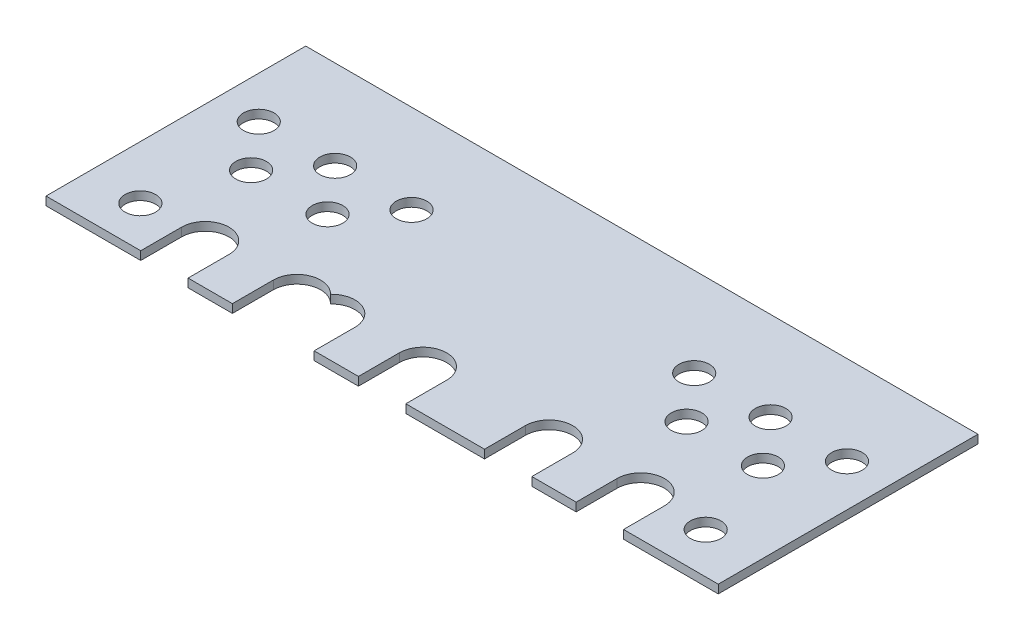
ISO-10303-21;
HEADER;
FILE_DESCRIPTION(('STEP AP214'),'2;1');
FILE_NAME('part.step','',(''),(''),'','','');
FILE_SCHEMA(('AUTOMOTIVE_DESIGN { 1 0 10303 214 1 1 1 1 }'));
ENDSEC;
DATA;
#1=APPLICATION_CONTEXT('core data for automotive mechanical design processes');
#2=APPLICATION_PROTOCOL_DEFINITION('international standard','automotive_design',2000,#1);
#3=PRODUCT_CONTEXT('',#1,'mechanical');
#4=PRODUCT('Part','Part','',(#3));
#5=PRODUCT_RELATED_PRODUCT_CATEGORY('part','',(#4));
#6=PRODUCT_DEFINITION_FORMATION('','',#4);
#7=PRODUCT_DEFINITION_CONTEXT('part definition',#1,'design');
#8=PRODUCT_DEFINITION('design','',#6,#7);
#9=PRODUCT_DEFINITION_SHAPE('','',#8);
#10=(LENGTH_UNIT() NAMED_UNIT(*) SI_UNIT(.MILLI.,.METRE.));
#11=(NAMED_UNIT(*) PLANE_ANGLE_UNIT() SI_UNIT($,.RADIAN.));
#12=(NAMED_UNIT(*) SI_UNIT($,.STERADIAN.) SOLID_ANGLE_UNIT());
#13=UNCERTAINTY_MEASURE_WITH_UNIT(LENGTH_MEASURE(1.E-05),#10,'distance_accuracy_value','');
#14=(GEOMETRIC_REPRESENTATION_CONTEXT(3) GLOBAL_UNCERTAINTY_ASSIGNED_CONTEXT((#13)) GLOBAL_UNIT_ASSIGNED_CONTEXT((#10,
#11,#12)) REPRESENTATION_CONTEXT('',''));
#15=CARTESIAN_POINT('',(0.,0.,0.));
#16=DIRECTION('',(0.,0.,1.));
#17=DIRECTION('',(1.,0.,0.));
#18=AXIS2_PLACEMENT_3D('',#15,#16,#17);
#19=CARTESIAN_POINT('',(44.,1.11,17.));
#20=DIRECTION('',(0.,0.,-1.));
#21=DIRECTION('',(-1.,0.,0.));
#22=AXIS2_PLACEMENT_3D('',#19,#20,#21);
#23=PLANE('',#22);
#24=DIRECTION('',(1.,0.,0.));
#25=VECTOR('',#24,1.);
#26=CARTESIAN_POINT('',(44.,0.,17.));
#27=LINE('',#26,#25);
#28=CARTESIAN_POINT('',(-8.9,0.,17.));
#29=VERTEX_POINT('',#28);
#30=CARTESIAN_POINT('',(-3.1,0.,17.));
#31=VERTEX_POINT('',#30);
#32=EDGE_CURVE('E226',#29,#31,#27,.T.);
#33=ORIENTED_EDGE('',*,*,#32,.T.);
#34=DIRECTION('',(0.,1.,0.));
#35=VECTOR('',#34,1.);
#36=CARTESIAN_POINT('',(-3.1,0.,17.));
#37=LINE('',#36,#35);
#38=CARTESIAN_POINT('',(-3.1,1.11,17.));
#39=VERTEX_POINT('',#38);
#40=EDGE_CURVE('E842',#31,#39,#37,.T.);
#41=ORIENTED_EDGE('',*,*,#40,.T.);
#42=DIRECTION('',(1.,0.,0.));
#43=VECTOR('',#42,1.);
#44=CARTESIAN_POINT('',(44.,1.11,17.));
#45=LINE('',#44,#43);
#46=CARTESIAN_POINT('',(-8.9,1.11,17.));
#47=VERTEX_POINT('',#46);
#48=EDGE_CURVE('E371',#47,#39,#45,.T.);
#49=ORIENTED_EDGE('',*,*,#48,.F.);
#50=DIRECTION('',(0.,1.,0.));
#51=VECTOR('',#50,1.);
#52=CARTESIAN_POINT('',(-8.9,0.,17.));
#53=LINE('',#52,#51);
#54=EDGE_CURVE('E267',#29,#47,#53,.T.);
#55=ORIENTED_EDGE('',*,*,#54,.F.);
#56=EDGE_LOOP('',(#33,#41,#49,#55));
#57=FACE_BOUND('',#56,.T.);
#58=ADVANCED_FACE('F35',(#57),#23,.F.);
#59=CARTESIAN_POINT('',(19.6,0.,17.));
#60=VERTEX_POINT('',#59);
#61=CARTESIAN_POINT('',(25.4,0.,17.));
#62=VERTEX_POINT('',#61);
#63=EDGE_CURVE('E227',#60,#62,#27,.T.);
#64=ORIENTED_EDGE('',*,*,#63,.T.);
#65=DIRECTION('',(0.,1.,0.));
#66=VECTOR('',#65,1.);
#67=CARTESIAN_POINT('',(25.4,0.,17.));
#68=LINE('',#67,#66);
#69=CARTESIAN_POINT('',(25.4,1.11,17.));
#70=VERTEX_POINT('',#69);
#71=EDGE_CURVE('E440',#62,#70,#68,.T.);
#72=ORIENTED_EDGE('',*,*,#71,.T.);
#73=CARTESIAN_POINT('',(19.6,1.11,17.));
#74=VERTEX_POINT('',#73);
#75=EDGE_CURVE('E862',#74,#70,#45,.T.);
#76=ORIENTED_EDGE('',*,*,#75,.F.);
#77=DIRECTION('',(0.,1.,0.));
#78=VECTOR('',#77,1.);
#79=CARTESIAN_POINT('',(19.6,0.,17.));
#80=LINE('',#79,#78);
#81=EDGE_CURVE('E435',#60,#74,#80,.T.);
#82=ORIENTED_EDGE('',*,*,#81,.F.);
#83=EDGE_LOOP('',(#64,#72,#76,#82));
#84=FACE_BOUND('',#83,.T.);
#85=ADVANCED_FACE('F496',(#84),#23,.F.);
#86=CARTESIAN_POINT('',(3.1,1.11,17.));
#87=VERTEX_POINT('',#86);
#88=CARTESIAN_POINT('',(13.4,1.11,17.));
#89=VERTEX_POINT('',#88);
#90=EDGE_CURVE('E218',#87,#89,#45,.T.);
#91=ORIENTED_EDGE('',*,*,#90,.F.);
#92=DIRECTION('',(0.,1.,0.));
#93=VECTOR('',#92,1.);
#94=CARTESIAN_POINT('',(3.1,0.,17.));
#95=LINE('',#94,#93);
#96=CARTESIAN_POINT('',(3.1,0.,17.));
#97=VERTEX_POINT('',#96);
#98=EDGE_CURVE('E205',#97,#87,#95,.T.);
#99=ORIENTED_EDGE('',*,*,#98,.F.);
#100=CARTESIAN_POINT('',(13.4,0.,17.));
#101=VERTEX_POINT('',#100);
#102=EDGE_CURVE('E216',#97,#101,#27,.T.);
#103=ORIENTED_EDGE('',*,*,#102,.T.);
#104=DIRECTION('',(0.,1.,0.));
#105=VECTOR('',#104,1.);
#106=CARTESIAN_POINT('',(13.4,0.,17.));
#107=LINE('',#106,#105);
#108=EDGE_CURVE('E445',#101,#89,#107,.T.);
#109=ORIENTED_EDGE('',*,*,#108,.T.);
#110=EDGE_LOOP('',(#91,#99,#103,#109));
#111=FACE_BOUND('',#110,.T.);
#112=ADVANCED_FACE('F214',(#111),#23,.F.);
#113=CARTESIAN_POINT('',(-44.,0.,17.));
#114=VERTEX_POINT('',#113);
#115=CARTESIAN_POINT('',(-31.6,0.,17.));
#116=VERTEX_POINT('',#115);
#117=EDGE_CURVE('E230',#114,#116,#27,.T.);
#118=ORIENTED_EDGE('',*,*,#117,.T.);
#119=DIRECTION('',(0.,1.,0.));
#120=VECTOR('',#119,1.);
#121=CARTESIAN_POINT('',(-31.6,0.,17.));
#122=LINE('',#121,#120);
#123=CARTESIAN_POINT('',(-31.6,1.11,17.));
#124=VERTEX_POINT('',#123);
#125=EDGE_CURVE('E279',#116,#124,#122,.T.);
#126=ORIENTED_EDGE('',*,*,#125,.T.);
#127=CARTESIAN_POINT('',(-44.,1.11,17.));
#128=VERTEX_POINT('',#127);
#129=EDGE_CURVE('E366',#128,#124,#45,.T.);
#130=ORIENTED_EDGE('',*,*,#129,.F.);
#131=DIRECTION('',(0.,-1.,0.));
#132=VECTOR('',#131,1.);
#133=CARTESIAN_POINT('',(-44.,1.11,17.));
#134=LINE('',#133,#132);
#135=EDGE_CURVE('E11',#128,#114,#134,.T.);
#136=ORIENTED_EDGE('',*,*,#135,.T.);
#137=EDGE_LOOP('',(#118,#126,#130,#136));
#138=FACE_BOUND('',#137,.T.);
#139=ADVANCED_FACE('F388',(#138),#23,.F.);
#140=CARTESIAN_POINT('',(-25.4,1.11,17.));
#141=VERTEX_POINT('',#140);
#142=CARTESIAN_POINT('',(-19.6,1.11,17.));
#143=VERTEX_POINT('',#142);
#144=EDGE_CURVE('E370',#141,#143,#45,.T.);
#145=ORIENTED_EDGE('',*,*,#144,.F.);
#146=DIRECTION('',(0.,1.,0.));
#147=VECTOR('',#146,1.);
#148=CARTESIAN_POINT('',(-25.4,0.,17.));
#149=LINE('',#148,#147);
#150=CARTESIAN_POINT('',(-25.4,0.,17.));
#151=VERTEX_POINT('',#150);
#152=EDGE_CURVE('E250',#151,#141,#149,.T.);
#153=ORIENTED_EDGE('',*,*,#152,.F.);
#154=CARTESIAN_POINT('',(-19.6,0.,17.));
#155=VERTEX_POINT('',#154);
#156=EDGE_CURVE('E232',#151,#155,#27,.T.);
#157=ORIENTED_EDGE('',*,*,#156,.T.);
#158=DIRECTION('',(0.,1.,0.));
#159=VECTOR('',#158,1.);
#160=CARTESIAN_POINT('',(-19.6,0.,17.));
#161=LINE('',#160,#159);
#162=EDGE_CURVE('E249',#155,#143,#161,.T.);
#163=ORIENTED_EDGE('',*,*,#162,.T.);
#164=EDGE_LOOP('',(#145,#153,#157,#163));
#165=FACE_BOUND('',#164,.T.);
#166=ADVANCED_FACE('F248',(#165),#23,.F.);
#167=CARTESIAN_POINT('',(-44.,1.11,17.));
#168=DIRECTION('',(1.,0.,0.));
#169=DIRECTION('',(0.,0.,-1.));
#170=AXIS2_PLACEMENT_3D('',#167,#168,#169);
#171=PLANE('',#170);
#172=DIRECTION('',(0.,0.,1.));
#173=VECTOR('',#172,1.);
#174=CARTESIAN_POINT('',(-44.,0.,17.));
#175=LINE('',#174,#173);
#176=CARTESIAN_POINT('',(-44.,0.,-17.));
#177=VERTEX_POINT('',#176);
#178=EDGE_CURVE('E236',#177,#114,#175,.T.);
#179=ORIENTED_EDGE('',*,*,#178,.T.);
#180=ORIENTED_EDGE('',*,*,#135,.F.);
#181=DIRECTION('',(0.,0.,1.));
#182=VECTOR('',#181,1.);
#183=CARTESIAN_POINT('',(-44.,1.11,17.));
#184=LINE('',#183,#182);
#185=CARTESIAN_POINT('',(-44.,1.11,-17.));
#186=VERTEX_POINT('',#185);
#187=EDGE_CURVE('E362',#186,#128,#184,.T.);
#188=ORIENTED_EDGE('',*,*,#187,.F.);
#189=DIRECTION('',(0.,-1.,0.));
#190=VECTOR('',#189,1.);
#191=CARTESIAN_POINT('',(-44.,1.11,-17.));
#192=LINE('',#191,#190);
#193=EDGE_CURVE('E374',#186,#177,#192,.T.);
#194=ORIENTED_EDGE('',*,*,#193,.T.);
#195=EDGE_LOOP('',(#179,#180,#188,#194));
#196=FACE_BOUND('',#195,.T.);
#197=ADVANCED_FACE('F37',(#196),#171,.F.);
#198=CARTESIAN_POINT('',(31.6,1.11,17.));
#199=VERTEX_POINT('',#198);
#200=CARTESIAN_POINT('',(44.,1.11,17.));
#201=VERTEX_POINT('',#200);
#202=EDGE_CURVE('E365',#199,#201,#45,.T.);
#203=ORIENTED_EDGE('',*,*,#202,.F.);
#204=DIRECTION('',(0.,1.,0.));
#205=VECTOR('',#204,1.);
#206=CARTESIAN_POINT('',(31.6,0.,17.));
#207=LINE('',#206,#205);
#208=CARTESIAN_POINT('',(31.6,0.,17.));
#209=VERTEX_POINT('',#208);
#210=EDGE_CURVE('E415',#209,#199,#207,.T.);
#211=ORIENTED_EDGE('',*,*,#210,.F.);
#212=CARTESIAN_POINT('',(44.,0.,17.));
#213=VERTEX_POINT('',#212);
#214=EDGE_CURVE('E229',#209,#213,#27,.T.);
#215=ORIENTED_EDGE('',*,*,#214,.T.);
#216=DIRECTION('',(0.,-1.,0.));
#217=VECTOR('',#216,1.);
#218=CARTESIAN_POINT('',(44.,1.11,17.));
#219=LINE('',#218,#217);
#220=EDGE_CURVE('E43',#201,#213,#219,.T.);
#221=ORIENTED_EDGE('',*,*,#220,.F.);
#222=EDGE_LOOP('',(#203,#211,#215,#221));
#223=FACE_BOUND('',#222,.T.);
#224=ADVANCED_FACE('F414',(#223),#23,.F.);
#225=CARTESIAN_POINT('',(44.,1.11,17.));
#226=DIRECTION('',(-1.,0.,0.));
#227=DIRECTION('',(0.,0.,1.));
#228=AXIS2_PLACEMENT_3D('',#225,#226,#227);
#229=PLANE('',#228);
#230=DIRECTION('',(0.,0.,-1.));
#231=VECTOR('',#230,1.);
#232=CARTESIAN_POINT('',(44.,0.,17.));
#233=LINE('',#232,#231);
#234=CARTESIAN_POINT('',(44.,0.,-17.));
#235=VERTEX_POINT('',#234);
#236=EDGE_CURVE('E238',#213,#235,#233,.T.);
#237=ORIENTED_EDGE('',*,*,#236,.T.);
#238=DIRECTION('',(0.,-1.,0.));
#239=VECTOR('',#238,1.);
#240=CARTESIAN_POINT('',(44.,1.11,-17.));
#241=LINE('',#240,#239);
#242=CARTESIAN_POINT('',(44.,1.11,-17.));
#243=VERTEX_POINT('',#242);
#244=EDGE_CURVE('E400',#243,#235,#241,.T.);
#245=ORIENTED_EDGE('',*,*,#244,.F.);
#246=DIRECTION('',(0.,0.,-1.));
#247=VECTOR('',#246,1.);
#248=CARTESIAN_POINT('',(44.,1.11,17.));
#249=LINE('',#248,#247);
#250=EDGE_CURVE('E369',#201,#243,#249,.T.);
#251=ORIENTED_EDGE('',*,*,#250,.F.);
#252=ORIENTED_EDGE('',*,*,#220,.T.);
#253=EDGE_LOOP('',(#237,#245,#251,#252));
#254=FACE_BOUND('',#253,.T.);
#255=ADVANCED_FACE('F407',(#254),#229,.F.);
#256=CARTESIAN_POINT('',(44.,1.11,-17.));
#257=DIRECTION('',(0.,0.,1.));
#258=DIRECTION('',(1.,0.,0.));
#259=AXIS2_PLACEMENT_3D('',#256,#257,#258);
#260=PLANE('',#259);
#261=DIRECTION('',(-1.,0.,0.));
#262=VECTOR('',#261,1.);
#263=CARTESIAN_POINT('',(44.,0.,-17.));
#264=LINE('',#263,#262);
#265=EDGE_CURVE('E241',#235,#177,#264,.T.);
#266=ORIENTED_EDGE('',*,*,#265,.T.);
#267=ORIENTED_EDGE('',*,*,#193,.F.);
#268=DIRECTION('',(-1.,0.,0.));
#269=VECTOR('',#268,1.);
#270=CARTESIAN_POINT('',(44.,1.11,-17.));
#271=LINE('',#270,#269);
#272=EDGE_CURVE('E373',#243,#186,#271,.T.);
#273=ORIENTED_EDGE('',*,*,#272,.F.);
#274=ORIENTED_EDGE('',*,*,#244,.T.);
#275=EDGE_LOOP('',(#266,#267,#273,#274));
#276=FACE_BOUND('',#275,.T.);
#277=ADVANCED_FACE('F399',(#276),#260,.F.);
#278=CARTESIAN_POINT('',(0.,1.11,0.));
#279=DIRECTION('',(0.,1.,0.));
#280=DIRECTION('',(0.,0.,1.));
#281=AXIS2_PLACEMENT_3D('',#278,#279,#280);
#282=PLANE('',#281);
#283=DIRECTION('',(0.,0.,1.));
#284=VECTOR('',#283,1.);
#285=CARTESIAN_POINT('',(-3.1,1.11,11.65));
#286=LINE('',#285,#284);
#287=CARTESIAN_POINT('',(-3.1,1.11,11.65));
#288=VERTEX_POINT('',#287);
#289=EDGE_CURVE('E210',#288,#39,#286,.T.);
#290=ORIENTED_EDGE('',*,*,#289,.F.);
#291=CARTESIAN_POINT('',(0.,1.11,11.65));
#292=DIRECTION('',(0.,1.,0.));
#293=DIRECTION('',(0.,0.,1.));
#294=AXIS2_PLACEMENT_3D('',#291,#292,#293);
#295=CIRCLE('',#294,3.1);
#296=CARTESIAN_POINT('',(3.1,1.11,11.65));
#297=VERTEX_POINT('',#296);
#298=EDGE_CURVE('E833',#297,#288,#295,.T.);
#299=ORIENTED_EDGE('',*,*,#298,.F.);
#300=DIRECTION('',(0.,0.,-1.));
#301=VECTOR('',#300,1.);
#302=CARTESIAN_POINT('',(3.1,1.11,17.));
#303=LINE('',#302,#301);
#304=EDGE_CURVE('E836',#87,#297,#303,.T.);
#305=ORIENTED_EDGE('',*,*,#304,.F.);
#306=ORIENTED_EDGE('',*,*,#90,.T.);
#307=DIRECTION('',(0.,0.,1.));
#308=VECTOR('',#307,1.);
#309=CARTESIAN_POINT('',(13.4,1.11,11.65));
#310=LINE('',#309,#308);
#311=CARTESIAN_POINT('',(13.4,1.11,11.65));
#312=VERTEX_POINT('',#311);
#313=EDGE_CURVE('E432',#312,#89,#310,.T.);
#314=ORIENTED_EDGE('',*,*,#313,.F.);
#315=CARTESIAN_POINT('',(16.5,1.11,11.65));
#316=DIRECTION('',(0.,1.,0.));
#317=DIRECTION('',(0.,0.,1.));
#318=AXIS2_PLACEMENT_3D('',#315,#316,#317);
#319=CIRCLE('',#318,3.1);
#320=CARTESIAN_POINT('',(19.6,1.11,11.65));
#321=VERTEX_POINT('',#320);
#322=EDGE_CURVE('E439',#321,#312,#319,.T.);
#323=ORIENTED_EDGE('',*,*,#322,.F.);
#324=DIRECTION('',(0.,0.,-1.));
#325=VECTOR('',#324,1.);
#326=CARTESIAN_POINT('',(19.6,1.11,17.));
#327=LINE('',#326,#325);
#328=EDGE_CURVE('E436',#74,#321,#327,.T.);
#329=ORIENTED_EDGE('',*,*,#328,.F.);
#330=ORIENTED_EDGE('',*,*,#75,.T.);
#331=DIRECTION('',(0.,0.,1.));
#332=VECTOR('',#331,1.);
#333=CARTESIAN_POINT('',(25.4,1.11,11.65));
#334=LINE('',#333,#332);
#335=CARTESIAN_POINT('',(25.4,1.11,11.65));
#336=VERTEX_POINT('',#335);
#337=EDGE_CURVE('E848',#336,#70,#334,.T.);
#338=ORIENTED_EDGE('',*,*,#337,.F.);
#339=CARTESIAN_POINT('',(28.5,1.11,11.65));
#340=DIRECTION('',(0.,1.,0.));
#341=DIRECTION('',(0.,0.,1.));
#342=AXIS2_PLACEMENT_3D('',#339,#340,#341);
#343=CIRCLE('',#342,3.1);
#344=CARTESIAN_POINT('',(31.6,1.11,11.65));
#345=VERTEX_POINT('',#344);
#346=EDGE_CURVE('E851',#345,#336,#343,.T.);
#347=ORIENTED_EDGE('',*,*,#346,.F.);
#348=DIRECTION('',(0.,0.,-1.));
#349=VECTOR('',#348,1.);
#350=CARTESIAN_POINT('',(31.6,1.11,17.));
#351=LINE('',#350,#349);
#352=EDGE_CURVE('E844',#199,#345,#351,.T.);
#353=ORIENTED_EDGE('',*,*,#352,.F.);
#354=ORIENTED_EDGE('',*,*,#202,.T.);
#355=ORIENTED_EDGE('',*,*,#250,.T.);
#356=ORIENTED_EDGE('',*,*,#272,.T.);
#357=ORIENTED_EDGE('',*,*,#187,.T.);
#358=ORIENTED_EDGE('',*,*,#129,.T.);
#359=DIRECTION('',(0.,0.,1.));
#360=VECTOR('',#359,1.);
#361=CARTESIAN_POINT('',(-31.6,1.11,11.65));
#362=LINE('',#361,#360);
#363=CARTESIAN_POINT('',(-31.6,1.11,11.65));
#364=VERTEX_POINT('',#363);
#365=EDGE_CURVE('E456',#364,#124,#362,.T.);
#366=ORIENTED_EDGE('',*,*,#365,.F.);
#367=CARTESIAN_POINT('',(-28.5,1.11,11.65));
#368=DIRECTION('',(0.,1.,0.));
#369=DIRECTION('',(0.,0.,1.));
#370=AXIS2_PLACEMENT_3D('',#367,#368,#369);
#371=CIRCLE('',#370,3.1);
#372=CARTESIAN_POINT('',(-25.4,1.11,11.65));
#373=VERTEX_POINT('',#372);
#374=EDGE_CURVE('E461',#373,#364,#371,.T.);
#375=ORIENTED_EDGE('',*,*,#374,.F.);
#376=DIRECTION('',(0.,0.,-1.));
#377=VECTOR('',#376,1.);
#378=CARTESIAN_POINT('',(-25.4,1.11,17.));
#379=LINE('',#378,#377);
#380=EDGE_CURVE('E447',#141,#373,#379,.T.);
#381=ORIENTED_EDGE('',*,*,#380,.F.);
#382=ORIENTED_EDGE('',*,*,#144,.T.);
#383=DIRECTION('',(0.,0.,1.));
#384=VECTOR('',#383,1.);
#385=CARTESIAN_POINT('',(-19.6,1.11,11.65));
#386=LINE('',#385,#384);
#387=CARTESIAN_POINT('',(-19.6,1.11,11.65));
#388=VERTEX_POINT('',#387);
#389=EDGE_CURVE('E260',#388,#143,#386,.T.);
#390=ORIENTED_EDGE('',*,*,#389,.F.);
#391=CARTESIAN_POINT('',(-16.5,1.11,11.65));
#392=DIRECTION('',(0.,1.,0.));
#393=DIRECTION('',(0.,0.,1.));
#394=AXIS2_PLACEMENT_3D('',#391,#392,#393);
#395=CIRCLE('',#394,3.1);
#396=CARTESIAN_POINT('',(-14.25,1.11,9.51751318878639));
#397=VERTEX_POINT('',#396);
#398=EDGE_CURVE('E282',#397,#388,#395,.T.);
#399=ORIENTED_EDGE('',*,*,#398,.F.);
#400=CARTESIAN_POINT('',(-12.,1.11,11.65));
#401=DIRECTION('',(0.,1.,0.));
#402=DIRECTION('',(0.,0.,-1.));
#403=AXIS2_PLACEMENT_3D('',#400,#401,#402);
#404=CIRCLE('',#403,3.1);
#405=CARTESIAN_POINT('',(-8.9,1.11,11.65));
#406=VERTEX_POINT('',#405);
#407=EDGE_CURVE('E278',#406,#397,#404,.T.);
#408=ORIENTED_EDGE('',*,*,#407,.F.);
#409=DIRECTION('',(0.,0.,-1.));
#410=VECTOR('',#409,1.);
#411=CARTESIAN_POINT('',(-8.9,1.11,11.65));
#412=LINE('',#411,#410);
#413=EDGE_CURVE('E275',#47,#406,#412,.T.);
#414=ORIENTED_EDGE('',*,*,#413,.F.);
#415=ORIENTED_EDGE('',*,*,#48,.T.);
#416=EDGE_LOOP('',(#290,#299,#305,#306,#314,#323,#329,#330,#338,#347,#353,#354,#355,#356,#357,
#358,#366,#375,#381,#382,#390,#399,#408,#414,#415));
#417=FACE_BOUND('',#416,.T.);
#418=CARTESIAN_POINT('',(37.,1.11,11.65));
#419=DIRECTION('',(0.,1.,0.));
#420=DIRECTION('',(0.,0.,1.));
#421=AXIS2_PLACEMENT_3D('',#418,#419,#420);
#422=CIRCLE('',#421,2.);
#423=CARTESIAN_POINT('',(37.,1.11,13.65));
#424=VERTEX_POINT('',#423);
#425=EDGE_CURVE('E261',#424,#424,#422,.T.);
#426=ORIENTED_EDGE('',*,*,#425,.F.);
#427=EDGE_LOOP('',(#426));
#428=FACE_BOUND('',#427,.T.);
#429=CARTESIAN_POINT('',(-37.,1.11,11.65));
#430=DIRECTION('',(0.,1.,0.));
#431=DIRECTION('',(0.,0.,1.));
#432=AXIS2_PLACEMENT_3D('',#429,#430,#431);
#433=CIRCLE('',#432,2.);
#434=CARTESIAN_POINT('',(-37.,1.11,13.65));
#435=VERTEX_POINT('',#434);
#436=EDGE_CURVE('E294',#435,#435,#433,.T.);
#437=ORIENTED_EDGE('',*,*,#436,.F.);
#438=EDGE_LOOP('',(#437));
#439=FACE_BOUND('',#438,.T.);
#440=CARTESIAN_POINT('',(33.5,1.11,0.650000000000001));
#441=DIRECTION('',(0.,1.,0.));
#442=DIRECTION('',(0.,0.,1.));
#443=AXIS2_PLACEMENT_3D('',#440,#441,#442);
#444=CIRCLE('',#443,2.);
#445=CARTESIAN_POINT('',(33.5,1.11,2.65));
#446=VERTEX_POINT('',#445);
#447=EDGE_CURVE('E300',#446,#446,#444,.T.);
#448=ORIENTED_EDGE('',*,*,#447,.F.);
#449=EDGE_LOOP('',(#448));
#450=FACE_BOUND('',#449,.T.);
#451=CARTESIAN_POINT('',(23.5,1.11,0.650000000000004));
#452=DIRECTION('',(0.,1.,0.));
#453=DIRECTION('',(0.,0.,1.));
#454=AXIS2_PLACEMENT_3D('',#451,#452,#453);
#455=CIRCLE('',#454,2.);
#456=CARTESIAN_POINT('',(23.5,1.11,2.65));
#457=VERTEX_POINT('',#456);
#458=EDGE_CURVE('E306',#457,#457,#455,.T.);
#459=ORIENTED_EDGE('',*,*,#458,.F.);
#460=EDGE_LOOP('',(#459));
#461=FACE_BOUND('',#460,.T.);
#462=CARTESIAN_POINT('',(38.5,1.11,-5.34999999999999));
#463=DIRECTION('',(0.,1.,0.));
#464=DIRECTION('',(0.,0.,1.));
#465=AXIS2_PLACEMENT_3D('',#462,#463,#464);
#466=CIRCLE('',#465,2.);
#467=CARTESIAN_POINT('',(38.5,1.11,-3.34999999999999));
#468=VERTEX_POINT('',#467);
#469=EDGE_CURVE('E312',#468,#468,#466,.T.);
#470=ORIENTED_EDGE('',*,*,#469,.F.);
#471=EDGE_LOOP('',(#470));
#472=FACE_BOUND('',#471,.T.);
#473=CARTESIAN_POINT('',(28.5,1.11,-5.34999999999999));
#474=DIRECTION('',(0.,1.,0.));
#475=DIRECTION('',(0.,0.,1.));
#476=AXIS2_PLACEMENT_3D('',#473,#474,#475);
#477=CIRCLE('',#476,2.);
#478=CARTESIAN_POINT('',(28.5,1.11,-3.34999999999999));
#479=VERTEX_POINT('',#478);
#480=EDGE_CURVE('E318',#479,#479,#477,.T.);
#481=ORIENTED_EDGE('',*,*,#480,.F.);
#482=EDGE_LOOP('',(#481));
#483=FACE_BOUND('',#482,.T.);
#484=CARTESIAN_POINT('',(18.5,1.11,-5.34999999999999));
#485=DIRECTION('',(0.,1.,0.));
#486=DIRECTION('',(0.,0.,1.));
#487=AXIS2_PLACEMENT_3D('',#484,#485,#486);
#488=CIRCLE('',#487,2.);
#489=CARTESIAN_POINT('',(18.5,1.11,-3.34999999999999));
#490=VERTEX_POINT('',#489);
#491=EDGE_CURVE('E324',#490,#490,#488,.T.);
#492=ORIENTED_EDGE('',*,*,#491,.F.);
#493=EDGE_LOOP('',(#492));
#494=FACE_BOUND('',#493,.T.);
#495=CARTESIAN_POINT('',(-23.5,1.11,0.65000000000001));
#496=DIRECTION('',(0.,1.,0.));
#497=DIRECTION('',(0.,0.,1.));
#498=AXIS2_PLACEMENT_3D('',#495,#496,#497);
#499=CIRCLE('',#498,2.);
#500=CARTESIAN_POINT('',(-23.5,1.11,2.65000000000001));
#501=VERTEX_POINT('',#500);
#502=EDGE_CURVE('E330',#501,#501,#499,.T.);
#503=ORIENTED_EDGE('',*,*,#502,.F.);
#504=EDGE_LOOP('',(#503));
#505=FACE_BOUND('',#504,.T.);
#506=CARTESIAN_POINT('',(-33.5,1.11,0.650000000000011));
#507=DIRECTION('',(0.,1.,0.));
#508=DIRECTION('',(0.,0.,1.));
#509=AXIS2_PLACEMENT_3D('',#506,#507,#508);
#510=CIRCLE('',#509,2.);
#511=CARTESIAN_POINT('',(-33.5,1.11,2.65000000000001));
#512=VERTEX_POINT('',#511);
#513=EDGE_CURVE('E336',#512,#512,#510,.T.);
#514=ORIENTED_EDGE('',*,*,#513,.F.);
#515=EDGE_LOOP('',(#514));
#516=FACE_BOUND('',#515,.T.);
#517=CARTESIAN_POINT('',(-18.5,1.11,-5.34999999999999));
#518=DIRECTION('',(0.,1.,0.));
#519=DIRECTION('',(0.,0.,1.));
#520=AXIS2_PLACEMENT_3D('',#517,#518,#519);
#521=CIRCLE('',#520,2.);
#522=CARTESIAN_POINT('',(-18.5,1.11,-3.34999999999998));
#523=VERTEX_POINT('',#522);
#524=EDGE_CURVE('E342',#523,#523,#521,.T.);
#525=ORIENTED_EDGE('',*,*,#524,.F.);
#526=EDGE_LOOP('',(#525));
#527=FACE_BOUND('',#526,.T.);
#528=CARTESIAN_POINT('',(-28.5,1.11,-5.34999999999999));
#529=DIRECTION('',(0.,1.,0.));
#530=DIRECTION('',(0.,0.,1.));
#531=AXIS2_PLACEMENT_3D('',#528,#529,#530);
#532=CIRCLE('',#531,2.);
#533=CARTESIAN_POINT('',(-28.5,1.11,-3.34999999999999));
#534=VERTEX_POINT('',#533);
#535=EDGE_CURVE('E348',#534,#534,#532,.T.);
#536=ORIENTED_EDGE('',*,*,#535,.F.);
#537=EDGE_LOOP('',(#536));
#538=FACE_BOUND('',#537,.T.);
#539=CARTESIAN_POINT('',(-38.5,1.11,-5.34999999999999));
#540=DIRECTION('',(0.,1.,0.));
#541=DIRECTION('',(0.,0.,1.));
#542=AXIS2_PLACEMENT_3D('',#539,#540,#541);
#543=CIRCLE('',#542,2.);
#544=CARTESIAN_POINT('',(-38.5,1.11,-3.34999999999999));
#545=VERTEX_POINT('',#544);
#546=EDGE_CURVE('E354',#545,#545,#543,.T.);
#547=ORIENTED_EDGE('',*,*,#546,.F.);
#548=EDGE_LOOP('',(#547));
#549=FACE_BOUND('',#548,.T.);
#550=ADVANCED_FACE('F392',(#417,#428,#439,#450,#461,#472,#483,#494,#505,#516,#527,#538,#549),
#282,.T.);
#551=CARTESIAN_POINT('',(0.,0.,0.));
#552=DIRECTION('',(0.,1.,0.));
#553=DIRECTION('',(0.,0.,1.));
#554=AXIS2_PLACEMENT_3D('',#551,#552,#553);
#555=PLANE('',#554);
#556=CARTESIAN_POINT('',(37.,0.,11.65));
#557=DIRECTION('',(0.,1.,0.));
#558=DIRECTION('',(0.,0.,1.));
#559=AXIS2_PLACEMENT_3D('',#556,#557,#558);
#560=CIRCLE('',#559,2.);
#561=CARTESIAN_POINT('',(37.,0.,13.65));
#562=VERTEX_POINT('',#561);
#563=EDGE_CURVE('E291',#562,#562,#560,.T.);
#564=ORIENTED_EDGE('',*,*,#563,.T.);
#565=EDGE_LOOP('',(#564));
#566=FACE_BOUND('',#565,.T.);
#567=CARTESIAN_POINT('',(-37.,0.,11.65));
#568=DIRECTION('',(0.,1.,0.));
#569=DIRECTION('',(0.,0.,1.));
#570=AXIS2_PLACEMENT_3D('',#567,#568,#569);
#571=CIRCLE('',#570,2.);
#572=CARTESIAN_POINT('',(-37.,0.,13.65));
#573=VERTEX_POINT('',#572);
#574=EDGE_CURVE('E297',#573,#573,#571,.T.);
#575=ORIENTED_EDGE('',*,*,#574,.T.);
#576=EDGE_LOOP('',(#575));
#577=FACE_BOUND('',#576,.T.);
#578=CARTESIAN_POINT('',(33.5,0.,0.650000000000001));
#579=DIRECTION('',(0.,1.,0.));
#580=DIRECTION('',(0.,0.,1.));
#581=AXIS2_PLACEMENT_3D('',#578,#579,#580);
#582=CIRCLE('',#581,2.);
#583=CARTESIAN_POINT('',(33.5,0.,2.65));
#584=VERTEX_POINT('',#583);
#585=EDGE_CURVE('E303',#584,#584,#582,.T.);
#586=ORIENTED_EDGE('',*,*,#585,.T.);
#587=EDGE_LOOP('',(#586));
#588=FACE_BOUND('',#587,.T.);
#589=CARTESIAN_POINT('',(23.5,0.,0.650000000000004));
#590=DIRECTION('',(0.,1.,0.));
#591=DIRECTION('',(0.,0.,1.));
#592=AXIS2_PLACEMENT_3D('',#589,#590,#591);
#593=CIRCLE('',#592,2.);
#594=CARTESIAN_POINT('',(23.5,0.,2.65));
#595=VERTEX_POINT('',#594);
#596=EDGE_CURVE('E309',#595,#595,#593,.T.);
#597=ORIENTED_EDGE('',*,*,#596,.T.);
#598=EDGE_LOOP('',(#597));
#599=FACE_BOUND('',#598,.T.);
#600=CARTESIAN_POINT('',(38.5,0.,-5.34999999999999));
#601=DIRECTION('',(0.,1.,0.));
#602=DIRECTION('',(0.,0.,1.));
#603=AXIS2_PLACEMENT_3D('',#600,#601,#602);
#604=CIRCLE('',#603,2.);
#605=CARTESIAN_POINT('',(38.5,0.,-3.34999999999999));
#606=VERTEX_POINT('',#605);
#607=EDGE_CURVE('E315',#606,#606,#604,.T.);
#608=ORIENTED_EDGE('',*,*,#607,.T.);
#609=EDGE_LOOP('',(#608));
#610=FACE_BOUND('',#609,.T.);
#611=CARTESIAN_POINT('',(28.5,0.,-5.34999999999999));
#612=DIRECTION('',(0.,1.,0.));
#613=DIRECTION('',(0.,0.,1.));
#614=AXIS2_PLACEMENT_3D('',#611,#612,#613);
#615=CIRCLE('',#614,2.);
#616=CARTESIAN_POINT('',(28.5,0.,-3.34999999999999));
#617=VERTEX_POINT('',#616);
#618=EDGE_CURVE('E321',#617,#617,#615,.T.);
#619=ORIENTED_EDGE('',*,*,#618,.T.);
#620=EDGE_LOOP('',(#619));
#621=FACE_BOUND('',#620,.T.);
#622=CARTESIAN_POINT('',(18.5,0.,-5.34999999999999));
#623=DIRECTION('',(0.,1.,0.));
#624=DIRECTION('',(0.,0.,1.));
#625=AXIS2_PLACEMENT_3D('',#622,#623,#624);
#626=CIRCLE('',#625,2.);
#627=CARTESIAN_POINT('',(18.5,0.,-3.34999999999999));
#628=VERTEX_POINT('',#627);
#629=EDGE_CURVE('E327',#628,#628,#626,.T.);
#630=ORIENTED_EDGE('',*,*,#629,.T.);
#631=EDGE_LOOP('',(#630));
#632=FACE_BOUND('',#631,.T.);
#633=CARTESIAN_POINT('',(-23.5,0.,0.65000000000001));
#634=DIRECTION('',(0.,1.,0.));
#635=DIRECTION('',(0.,0.,1.));
#636=AXIS2_PLACEMENT_3D('',#633,#634,#635);
#637=CIRCLE('',#636,2.);
#638=CARTESIAN_POINT('',(-23.5,0.,2.65000000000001));
#639=VERTEX_POINT('',#638);
#640=EDGE_CURVE('E333',#639,#639,#637,.T.);
#641=ORIENTED_EDGE('',*,*,#640,.T.);
#642=EDGE_LOOP('',(#641));
#643=FACE_BOUND('',#642,.T.);
#644=CARTESIAN_POINT('',(-33.5,0.,0.650000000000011));
#645=DIRECTION('',(0.,1.,0.));
#646=DIRECTION('',(0.,0.,1.));
#647=AXIS2_PLACEMENT_3D('',#644,#645,#646);
#648=CIRCLE('',#647,2.);
#649=CARTESIAN_POINT('',(-33.5,0.,2.65000000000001));
#650=VERTEX_POINT('',#649);
#651=EDGE_CURVE('E339',#650,#650,#648,.T.);
#652=ORIENTED_EDGE('',*,*,#651,.T.);
#653=EDGE_LOOP('',(#652));
#654=FACE_BOUND('',#653,.T.);
#655=CARTESIAN_POINT('',(-18.5,0.,-5.34999999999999));
#656=DIRECTION('',(0.,1.,0.));
#657=DIRECTION('',(0.,0.,1.));
#658=AXIS2_PLACEMENT_3D('',#655,#656,#657);
#659=CIRCLE('',#658,2.);
#660=CARTESIAN_POINT('',(-18.5,0.,-3.34999999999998));
#661=VERTEX_POINT('',#660);
#662=EDGE_CURVE('E345',#661,#661,#659,.T.);
#663=ORIENTED_EDGE('',*,*,#662,.T.);
#664=EDGE_LOOP('',(#663));
#665=FACE_BOUND('',#664,.T.);
#666=CARTESIAN_POINT('',(-28.5,0.,-5.34999999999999));
#667=DIRECTION('',(0.,1.,0.));
#668=DIRECTION('',(0.,0.,1.));
#669=AXIS2_PLACEMENT_3D('',#666,#667,#668);
#670=CIRCLE('',#669,2.);
#671=CARTESIAN_POINT('',(-28.5,0.,-3.34999999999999));
#672=VERTEX_POINT('',#671);
#673=EDGE_CURVE('E351',#672,#672,#670,.T.);
#674=ORIENTED_EDGE('',*,*,#673,.T.);
#675=EDGE_LOOP('',(#674));
#676=FACE_BOUND('',#675,.T.);
#677=CARTESIAN_POINT('',(-38.5,0.,-5.34999999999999));
#678=DIRECTION('',(0.,1.,0.));
#679=DIRECTION('',(0.,0.,1.));
#680=AXIS2_PLACEMENT_3D('',#677,#678,#679);
#681=CIRCLE('',#680,2.);
#682=CARTESIAN_POINT('',(-38.5,0.,-3.34999999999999));
#683=VERTEX_POINT('',#682);
#684=EDGE_CURVE('E357',#683,#683,#681,.T.);
#685=ORIENTED_EDGE('',*,*,#684,.T.);
#686=EDGE_LOOP('',(#685));
#687=FACE_BOUND('',#686,.T.);
#688=CARTESIAN_POINT('',(0.,0.,11.65));
#689=DIRECTION('',(0.,1.,0.));
#690=DIRECTION('',(0.,0.,1.));
#691=AXIS2_PLACEMENT_3D('',#688,#689,#690);
#692=CIRCLE('',#691,3.1);
#693=CARTESIAN_POINT('',(3.1,0.,11.65));
#694=VERTEX_POINT('',#693);
#695=CARTESIAN_POINT('',(-3.1,0.,11.65));
#696=VERTEX_POINT('',#695);
#697=EDGE_CURVE('E50',#694,#696,#692,.T.);
#698=ORIENTED_EDGE('',*,*,#697,.T.);
#699=DIRECTION('',(0.,0.,1.));
#700=VECTOR('',#699,1.);
#701=CARTESIAN_POINT('',(-3.1,0.,11.65));
#702=LINE('',#701,#700);
#703=EDGE_CURVE('E219',#696,#31,#702,.T.);
#704=ORIENTED_EDGE('',*,*,#703,.T.);
#705=ORIENTED_EDGE('',*,*,#32,.F.);
#706=DIRECTION('',(0.,0.,-1.));
#707=VECTOR('',#706,1.);
#708=CARTESIAN_POINT('',(-8.9,0.,11.65));
#709=LINE('',#708,#707);
#710=CARTESIAN_POINT('',(-8.9,0.,11.65));
#711=VERTEX_POINT('',#710);
#712=EDGE_CURVE('E285',#29,#711,#709,.T.);
#713=ORIENTED_EDGE('',*,*,#712,.T.);
#714=CARTESIAN_POINT('',(-12.,0.,11.65));
#715=DIRECTION('',(0.,1.,0.));
#716=DIRECTION('',(0.,0.,-1.));
#717=AXIS2_PLACEMENT_3D('',#714,#715,#716);
#718=CIRCLE('',#717,3.1);
#719=CARTESIAN_POINT('',(-14.25,0.,9.51751318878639));
#720=VERTEX_POINT('',#719);
#721=EDGE_CURVE('E271',#711,#720,#718,.T.);
#722=ORIENTED_EDGE('',*,*,#721,.T.);
#723=CARTESIAN_POINT('',(-16.5,0.,11.65));
#724=DIRECTION('',(0.,1.,0.));
#725=DIRECTION('',(0.,0.,1.));
#726=AXIS2_PLACEMENT_3D('',#723,#724,#725);
#727=CIRCLE('',#726,3.1);
#728=CARTESIAN_POINT('',(-19.6,0.,11.65));
#729=VERTEX_POINT('',#728);
#730=EDGE_CURVE('E266',#720,#729,#727,.T.);
#731=ORIENTED_EDGE('',*,*,#730,.T.);
#732=DIRECTION('',(0.,0.,1.));
#733=VECTOR('',#732,1.);
#734=CARTESIAN_POINT('',(-19.6,0.,11.65));
#735=LINE('',#734,#733);
#736=EDGE_CURVE('E257',#729,#155,#735,.T.);
#737=ORIENTED_EDGE('',*,*,#736,.T.);
#738=ORIENTED_EDGE('',*,*,#156,.F.);
#739=DIRECTION('',(0.,0.,-1.));
#740=VECTOR('',#739,1.);
#741=CARTESIAN_POINT('',(-25.4,0.,17.));
#742=LINE('',#741,#740);
#743=CARTESIAN_POINT('',(-25.4,0.,11.65));
#744=VERTEX_POINT('',#743);
#745=EDGE_CURVE('E453',#151,#744,#742,.T.);
#746=ORIENTED_EDGE('',*,*,#745,.T.);
#747=CARTESIAN_POINT('',(-28.5,0.,11.65));
#748=DIRECTION('',(0.,1.,0.));
#749=DIRECTION('',(0.,0.,1.));
#750=AXIS2_PLACEMENT_3D('',#747,#748,#749);
#751=CIRCLE('',#750,3.1);
#752=CARTESIAN_POINT('',(-31.6,0.,11.65));
#753=VERTEX_POINT('',#752);
#754=EDGE_CURVE('E455',#744,#753,#751,.T.);
#755=ORIENTED_EDGE('',*,*,#754,.T.);
#756=DIRECTION('',(0.,0.,1.));
#757=VECTOR('',#756,1.);
#758=CARTESIAN_POINT('',(-31.6,0.,11.65));
#759=LINE('',#758,#757);
#760=EDGE_CURVE('E387',#753,#116,#759,.T.);
#761=ORIENTED_EDGE('',*,*,#760,.T.);
#762=ORIENTED_EDGE('',*,*,#117,.F.);
#763=ORIENTED_EDGE('',*,*,#178,.F.);
#764=ORIENTED_EDGE('',*,*,#265,.F.);
#765=ORIENTED_EDGE('',*,*,#236,.F.);
#766=ORIENTED_EDGE('',*,*,#214,.F.);
#767=DIRECTION('',(0.,0.,-1.));
#768=VECTOR('',#767,1.);
#769=CARTESIAN_POINT('',(31.6,0.,17.));
#770=LINE('',#769,#768);
#771=CARTESIAN_POINT('',(31.6,0.,11.65));
#772=VERTEX_POINT('',#771);
#773=EDGE_CURVE('E412',#209,#772,#770,.T.);
#774=ORIENTED_EDGE('',*,*,#773,.T.);
#775=CARTESIAN_POINT('',(28.5,0.,11.65));
#776=DIRECTION('',(0.,1.,0.));
#777=DIRECTION('',(0.,0.,1.));
#778=AXIS2_PLACEMENT_3D('',#775,#776,#777);
#779=CIRCLE('',#778,3.1);
#780=CARTESIAN_POINT('',(25.4,0.,11.65));
#781=VERTEX_POINT('',#780);
#782=EDGE_CURVE('E58',#772,#781,#779,.T.);
#783=ORIENTED_EDGE('',*,*,#782,.T.);
#784=DIRECTION('',(0.,0.,1.));
#785=VECTOR('',#784,1.);
#786=CARTESIAN_POINT('',(25.4,0.,11.65));
#787=LINE('',#786,#785);
#788=EDGE_CURVE('E420',#781,#62,#787,.T.);
#789=ORIENTED_EDGE('',*,*,#788,.T.);
#790=ORIENTED_EDGE('',*,*,#63,.F.);
#791=DIRECTION('',(0.,0.,-1.));
#792=VECTOR('',#791,1.);
#793=CARTESIAN_POINT('',(19.6,0.,17.));
#794=LINE('',#793,#792);
#795=CARTESIAN_POINT('',(19.6,0.,11.65));
#796=VERTEX_POINT('',#795);
#797=EDGE_CURVE('E428',#60,#796,#794,.T.);
#798=ORIENTED_EDGE('',*,*,#797,.T.);
#799=CARTESIAN_POINT('',(16.5,0.,11.65));
#800=DIRECTION('',(0.,1.,0.));
#801=DIRECTION('',(0.,0.,1.));
#802=AXIS2_PLACEMENT_3D('',#799,#800,#801);
#803=CIRCLE('',#802,3.1);
#804=CARTESIAN_POINT('',(13.4,0.,11.65));
#805=VERTEX_POINT('',#804);
#806=EDGE_CURVE('E431',#796,#805,#803,.T.);
#807=ORIENTED_EDGE('',*,*,#806,.T.);
#808=DIRECTION('',(0.,0.,1.));
#809=VECTOR('',#808,1.);
#810=CARTESIAN_POINT('',(13.4,0.,11.65));
#811=LINE('',#810,#809);
#812=EDGE_CURVE('E225',#805,#101,#811,.T.);
#813=ORIENTED_EDGE('',*,*,#812,.T.);
#814=ORIENTED_EDGE('',*,*,#102,.F.);
#815=DIRECTION('',(0.,0.,-1.));
#816=VECTOR('',#815,1.);
#817=CARTESIAN_POINT('',(3.1,0.,17.));
#818=LINE('',#817,#816);
#819=EDGE_CURVE('E201',#97,#694,#818,.T.);
#820=ORIENTED_EDGE('',*,*,#819,.T.);
#821=EDGE_LOOP('',(#698,#704,#705,#713,#722,#731,#737,#738,#746,#755,#761,#762,#763,#764,#765,
#766,#774,#783,#789,#790,#798,#807,#813,#814,#820));
#822=FACE_BOUND('',#821,.T.);
#823=ADVANCED_FACE('F222',(#566,#577,#588,#599,#610,#621,#632,#643,#654,#665,#676,#687,#822),
#555,.F.);
#824=CARTESIAN_POINT('',(-38.5,0.,-5.34999999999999));
#825=DIRECTION('',(0.,1.,0.));
#826=DIRECTION('',(0.,0.,1.));
#827=AXIS2_PLACEMENT_3D('',#824,#825,#826);
#828=CYLINDRICAL_SURFACE('',#827,2.);
#829=ORIENTED_EDGE('',*,*,#684,.F.);
#830=EDGE_LOOP('',(#829));
#831=FACE_BOUND('',#830,.T.);
#832=ORIENTED_EDGE('',*,*,#546,.T.);
#833=EDGE_LOOP('',(#832));
#834=FACE_BOUND('',#833,.T.);
#835=ADVANCED_FACE('F636',(#831,#834),#828,.F.);
#836=CARTESIAN_POINT('',(-28.5,0.,-5.34999999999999));
#837=DIRECTION('',(0.,1.,0.));
#838=DIRECTION('',(0.,0.,1.));
#839=AXIS2_PLACEMENT_3D('',#836,#837,#838);
#840=CYLINDRICAL_SURFACE('',#839,2.);
#841=ORIENTED_EDGE('',*,*,#673,.F.);
#842=EDGE_LOOP('',(#841));
#843=FACE_BOUND('',#842,.T.);
#844=ORIENTED_EDGE('',*,*,#535,.T.);
#845=EDGE_LOOP('',(#844));
#846=FACE_BOUND('',#845,.T.);
#847=ADVANCED_FACE('F626',(#843,#846),#840,.F.);
#848=CARTESIAN_POINT('',(-18.5,0.,-5.34999999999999));
#849=DIRECTION('',(0.,1.,0.));
#850=DIRECTION('',(0.,0.,1.));
#851=AXIS2_PLACEMENT_3D('',#848,#849,#850);
#852=CYLINDRICAL_SURFACE('',#851,2.);
#853=ORIENTED_EDGE('',*,*,#662,.F.);
#854=EDGE_LOOP('',(#853));
#855=FACE_BOUND('',#854,.T.);
#856=ORIENTED_EDGE('',*,*,#524,.T.);
#857=EDGE_LOOP('',(#856));
#858=FACE_BOUND('',#857,.T.);
#859=ADVANCED_FACE('F616',(#855,#858),#852,.F.);
#860=CARTESIAN_POINT('',(-33.5,0.,0.650000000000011));
#861=DIRECTION('',(0.,1.,0.));
#862=DIRECTION('',(0.,0.,1.));
#863=AXIS2_PLACEMENT_3D('',#860,#861,#862);
#864=CYLINDRICAL_SURFACE('',#863,2.);
#865=ORIENTED_EDGE('',*,*,#651,.F.);
#866=EDGE_LOOP('',(#865));
#867=FACE_BOUND('',#866,.T.);
#868=ORIENTED_EDGE('',*,*,#513,.T.);
#869=EDGE_LOOP('',(#868));
#870=FACE_BOUND('',#869,.T.);
#871=ADVANCED_FACE('F606',(#867,#870),#864,.F.);
#872=CARTESIAN_POINT('',(-23.5,0.,0.65000000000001));
#873=DIRECTION('',(0.,1.,0.));
#874=DIRECTION('',(0.,0.,1.));
#875=AXIS2_PLACEMENT_3D('',#872,#873,#874);
#876=CYLINDRICAL_SURFACE('',#875,2.);
#877=ORIENTED_EDGE('',*,*,#640,.F.);
#878=EDGE_LOOP('',(#877));
#879=FACE_BOUND('',#878,.T.);
#880=ORIENTED_EDGE('',*,*,#502,.T.);
#881=EDGE_LOOP('',(#880));
#882=FACE_BOUND('',#881,.T.);
#883=ADVANCED_FACE('F596',(#879,#882),#876,.F.);
#884=CARTESIAN_POINT('',(18.5,0.,-5.34999999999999));
#885=DIRECTION('',(0.,1.,0.));
#886=DIRECTION('',(0.,0.,1.));
#887=AXIS2_PLACEMENT_3D('',#884,#885,#886);
#888=CYLINDRICAL_SURFACE('',#887,2.);
#889=ORIENTED_EDGE('',*,*,#629,.F.);
#890=EDGE_LOOP('',(#889));
#891=FACE_BOUND('',#890,.T.);
#892=ORIENTED_EDGE('',*,*,#491,.T.);
#893=EDGE_LOOP('',(#892));
#894=FACE_BOUND('',#893,.T.);
#895=ADVANCED_FACE('F586',(#891,#894),#888,.F.);
#896=CARTESIAN_POINT('',(28.5,0.,-5.34999999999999));
#897=DIRECTION('',(0.,1.,0.));
#898=DIRECTION('',(0.,0.,1.));
#899=AXIS2_PLACEMENT_3D('',#896,#897,#898);
#900=CYLINDRICAL_SURFACE('',#899,2.);
#901=ORIENTED_EDGE('',*,*,#618,.F.);
#902=EDGE_LOOP('',(#901));
#903=FACE_BOUND('',#902,.T.);
#904=ORIENTED_EDGE('',*,*,#480,.T.);
#905=EDGE_LOOP('',(#904));
#906=FACE_BOUND('',#905,.T.);
#907=ADVANCED_FACE('F576',(#903,#906),#900,.F.);
#908=CARTESIAN_POINT('',(38.5,0.,-5.34999999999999));
#909=DIRECTION('',(0.,1.,0.));
#910=DIRECTION('',(0.,0.,1.));
#911=AXIS2_PLACEMENT_3D('',#908,#909,#910);
#912=CYLINDRICAL_SURFACE('',#911,2.);
#913=ORIENTED_EDGE('',*,*,#607,.F.);
#914=EDGE_LOOP('',(#913));
#915=FACE_BOUND('',#914,.T.);
#916=ORIENTED_EDGE('',*,*,#469,.T.);
#917=EDGE_LOOP('',(#916));
#918=FACE_BOUND('',#917,.T.);
#919=ADVANCED_FACE('F566',(#915,#918),#912,.F.);
#920=CARTESIAN_POINT('',(23.5,0.,0.650000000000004));
#921=DIRECTION('',(0.,1.,0.));
#922=DIRECTION('',(0.,0.,1.));
#923=AXIS2_PLACEMENT_3D('',#920,#921,#922);
#924=CYLINDRICAL_SURFACE('',#923,2.);
#925=ORIENTED_EDGE('',*,*,#596,.F.);
#926=EDGE_LOOP('',(#925));
#927=FACE_BOUND('',#926,.T.);
#928=ORIENTED_EDGE('',*,*,#458,.T.);
#929=EDGE_LOOP('',(#928));
#930=FACE_BOUND('',#929,.T.);
#931=ADVANCED_FACE('F556',(#927,#930),#924,.F.);
#932=CARTESIAN_POINT('',(33.5,0.,0.650000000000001));
#933=DIRECTION('',(0.,1.,0.));
#934=DIRECTION('',(0.,0.,1.));
#935=AXIS2_PLACEMENT_3D('',#932,#933,#934);
#936=CYLINDRICAL_SURFACE('',#935,2.);
#937=ORIENTED_EDGE('',*,*,#585,.F.);
#938=EDGE_LOOP('',(#937));
#939=FACE_BOUND('',#938,.T.);
#940=ORIENTED_EDGE('',*,*,#447,.T.);
#941=EDGE_LOOP('',(#940));
#942=FACE_BOUND('',#941,.T.);
#943=ADVANCED_FACE('F546',(#939,#942),#936,.F.);
#944=CARTESIAN_POINT('',(-37.,0.,11.65));
#945=DIRECTION('',(0.,1.,0.));
#946=DIRECTION('',(0.,0.,1.));
#947=AXIS2_PLACEMENT_3D('',#944,#945,#946);
#948=CYLINDRICAL_SURFACE('',#947,2.);
#949=ORIENTED_EDGE('',*,*,#574,.F.);
#950=EDGE_LOOP('',(#949));
#951=FACE_BOUND('',#950,.T.);
#952=ORIENTED_EDGE('',*,*,#436,.T.);
#953=EDGE_LOOP('',(#952));
#954=FACE_BOUND('',#953,.T.);
#955=ADVANCED_FACE('F535',(#951,#954),#948,.F.);
#956=CARTESIAN_POINT('',(37.,0.,11.65));
#957=DIRECTION('',(0.,1.,0.));
#958=DIRECTION('',(0.,0.,1.));
#959=AXIS2_PLACEMENT_3D('',#956,#957,#958);
#960=CYLINDRICAL_SURFACE('',#959,2.);
#961=ORIENTED_EDGE('',*,*,#563,.F.);
#962=EDGE_LOOP('',(#961));
#963=FACE_BOUND('',#962,.T.);
#964=ORIENTED_EDGE('',*,*,#425,.T.);
#965=EDGE_LOOP('',(#964));
#966=FACE_BOUND('',#965,.T.);
#967=ADVANCED_FACE('F493',(#963,#966),#960,.F.);
#968=CARTESIAN_POINT('',(-19.6,0.,11.65));
#969=DIRECTION('',(-1.,0.,0.));
#970=DIRECTION('',(0.,0.,1.));
#971=AXIS2_PLACEMENT_3D('',#968,#969,#970);
#972=PLANE('',#971);
#973=ORIENTED_EDGE('',*,*,#389,.T.);
#974=ORIENTED_EDGE('',*,*,#162,.F.);
#975=ORIENTED_EDGE('',*,*,#736,.F.);
#976=DIRECTION('',(0.,1.,0.));
#977=VECTOR('',#976,1.);
#978=CARTESIAN_POINT('',(-19.6,0.,11.65));
#979=LINE('',#978,#977);
#980=EDGE_CURVE('E262',#729,#388,#979,.T.);
#981=ORIENTED_EDGE('',*,*,#980,.T.);
#982=EDGE_LOOP('',(#973,#974,#975,#981));
#983=FACE_BOUND('',#982,.T.);
#984=ADVANCED_FACE('F256',(#983),#972,.F.);
#985=CARTESIAN_POINT('',(-16.5,0.,11.65));
#986=DIRECTION('',(0.,1.,0.));
#987=DIRECTION('',(0.,0.,1.));
#988=AXIS2_PLACEMENT_3D('',#985,#986,#987);
#989=CYLINDRICAL_SURFACE('',#988,3.1);
#990=ORIENTED_EDGE('',*,*,#398,.T.);
#991=ORIENTED_EDGE('',*,*,#980,.F.);
#992=ORIENTED_EDGE('',*,*,#730,.F.);
#993=DIRECTION('',(0.,1.,0.));
#994=VECTOR('',#993,1.);
#995=CARTESIAN_POINT('',(-14.25,0.,9.51751318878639));
#996=LINE('',#995,#994);
#997=EDGE_CURVE('E288',#720,#397,#996,.T.);
#998=ORIENTED_EDGE('',*,*,#997,.T.);
#999=EDGE_LOOP('',(#990,#991,#992,#998));
#1000=FACE_BOUND('',#999,.T.);
#1001=ADVANCED_FACE('F485',(#1000),#989,.F.);
#1002=CARTESIAN_POINT('',(-12.,0.,11.65));
#1003=DIRECTION('',(0.,1.,0.));
#1004=DIRECTION('',(0.,0.,1.));
#1005=AXIS2_PLACEMENT_3D('',#1002,#1003,#1004);
#1006=CYLINDRICAL_SURFACE('',#1005,3.1);
#1007=ORIENTED_EDGE('',*,*,#407,.T.);
#1008=ORIENTED_EDGE('',*,*,#997,.F.);
#1009=ORIENTED_EDGE('',*,*,#721,.F.);
#1010=DIRECTION('',(0.,1.,0.));
#1011=VECTOR('',#1010,1.);
#1012=CARTESIAN_POINT('',(-8.9,0.,11.65));
#1013=LINE('',#1012,#1011);
#1014=EDGE_CURVE('E269',#711,#406,#1013,.T.);
#1015=ORIENTED_EDGE('',*,*,#1014,.T.);
#1016=EDGE_LOOP('',(#1007,#1008,#1009,#1015));
#1017=FACE_BOUND('',#1016,.T.);
#1018=ADVANCED_FACE('F475',(#1017),#1006,.F.);
#1019=CARTESIAN_POINT('',(-8.9,0.,11.65));
#1020=DIRECTION('',(1.,0.,0.));
#1021=DIRECTION('',(0.,0.,-1.));
#1022=AXIS2_PLACEMENT_3D('',#1019,#1020,#1021);
#1023=PLANE('',#1022);
#1024=ORIENTED_EDGE('',*,*,#413,.T.);
#1025=ORIENTED_EDGE('',*,*,#1014,.F.);
#1026=ORIENTED_EDGE('',*,*,#712,.F.);
#1027=ORIENTED_EDGE('',*,*,#54,.T.);
#1028=EDGE_LOOP('',(#1024,#1025,#1026,#1027));
#1029=FACE_BOUND('',#1028,.T.);
#1030=ADVANCED_FACE('F477',(#1029),#1023,.F.);
#1031=CARTESIAN_POINT('',(-31.6,0.,11.65));
#1032=DIRECTION('',(-1.,0.,0.));
#1033=DIRECTION('',(0.,0.,1.));
#1034=AXIS2_PLACEMENT_3D('',#1031,#1032,#1033);
#1035=PLANE('',#1034);
#1036=ORIENTED_EDGE('',*,*,#365,.T.);
#1037=ORIENTED_EDGE('',*,*,#125,.F.);
#1038=ORIENTED_EDGE('',*,*,#760,.F.);
#1039=DIRECTION('',(0.,1.,0.));
#1040=VECTOR('',#1039,1.);
#1041=CARTESIAN_POINT('',(-31.6,0.,11.65));
#1042=LINE('',#1041,#1040);
#1043=EDGE_CURVE('E466',#753,#364,#1042,.T.);
#1044=ORIENTED_EDGE('',*,*,#1043,.T.);
#1045=EDGE_LOOP('',(#1036,#1037,#1038,#1044));
#1046=FACE_BOUND('',#1045,.T.);
#1047=ADVANCED_FACE('F713',(#1046),#1035,.F.);
#1048=CARTESIAN_POINT('',(-28.5,0.,11.65));
#1049=DIRECTION('',(0.,1.,0.));
#1050=DIRECTION('',(0.,0.,1.));
#1051=AXIS2_PLACEMENT_3D('',#1048,#1049,#1050);
#1052=CYLINDRICAL_SURFACE('',#1051,3.1);
#1053=ORIENTED_EDGE('',*,*,#374,.T.);
#1054=ORIENTED_EDGE('',*,*,#1043,.F.);
#1055=ORIENTED_EDGE('',*,*,#754,.F.);
#1056=DIRECTION('',(0.,1.,0.));
#1057=VECTOR('',#1056,1.);
#1058=CARTESIAN_POINT('',(-25.4,0.,11.65));
#1059=LINE('',#1058,#1057);
#1060=EDGE_CURVE('E468',#744,#373,#1059,.T.);
#1061=ORIENTED_EDGE('',*,*,#1060,.T.);
#1062=EDGE_LOOP('',(#1053,#1054,#1055,#1061));
#1063=FACE_BOUND('',#1062,.T.);
#1064=ADVANCED_FACE('F722',(#1063),#1052,.F.);
#1065=CARTESIAN_POINT('',(-25.4,0.,17.));
#1066=DIRECTION('',(1.,0.,0.));
#1067=DIRECTION('',(0.,0.,-1.));
#1068=AXIS2_PLACEMENT_3D('',#1065,#1066,#1067);
#1069=PLANE('',#1068);
#1070=ORIENTED_EDGE('',*,*,#380,.T.);
#1071=ORIENTED_EDGE('',*,*,#1060,.F.);
#1072=ORIENTED_EDGE('',*,*,#745,.F.);
#1073=ORIENTED_EDGE('',*,*,#152,.T.);
#1074=EDGE_LOOP('',(#1070,#1071,#1072,#1073));
#1075=FACE_BOUND('',#1074,.T.);
#1076=ADVANCED_FACE('F732',(#1075),#1069,.F.);
#1077=CARTESIAN_POINT('',(13.4,0.,11.65));
#1078=DIRECTION('',(-1.,0.,0.));
#1079=DIRECTION('',(0.,0.,1.));
#1080=AXIS2_PLACEMENT_3D('',#1077,#1078,#1079);
#1081=PLANE('',#1080);
#1082=ORIENTED_EDGE('',*,*,#313,.T.);
#1083=ORIENTED_EDGE('',*,*,#108,.F.);
#1084=ORIENTED_EDGE('',*,*,#812,.F.);
#1085=DIRECTION('',(0.,1.,0.));
#1086=VECTOR('',#1085,1.);
#1087=CARTESIAN_POINT('',(13.4,0.,11.65));
#1088=LINE('',#1087,#1086);
#1089=EDGE_CURVE('E448',#805,#312,#1088,.T.);
#1090=ORIENTED_EDGE('',*,*,#1089,.T.);
#1091=EDGE_LOOP('',(#1082,#1083,#1084,#1090));
#1092=FACE_BOUND('',#1091,.T.);
#1093=ADVANCED_FACE('F742',(#1092),#1081,.F.);
#1094=CARTESIAN_POINT('',(16.5,0.,11.65));
#1095=DIRECTION('',(0.,1.,0.));
#1096=DIRECTION('',(0.,0.,1.));
#1097=AXIS2_PLACEMENT_3D('',#1094,#1095,#1096);
#1098=CYLINDRICAL_SURFACE('',#1097,3.1);
#1099=ORIENTED_EDGE('',*,*,#322,.T.);
#1100=ORIENTED_EDGE('',*,*,#1089,.F.);
#1101=ORIENTED_EDGE('',*,*,#806,.F.);
#1102=DIRECTION('',(0.,1.,0.));
#1103=VECTOR('',#1102,1.);
#1104=CARTESIAN_POINT('',(19.6,0.,11.65));
#1105=LINE('',#1104,#1103);
#1106=EDGE_CURVE('E450',#796,#321,#1105,.T.);
#1107=ORIENTED_EDGE('',*,*,#1106,.T.);
#1108=EDGE_LOOP('',(#1099,#1100,#1101,#1107));
#1109=FACE_BOUND('',#1108,.T.);
#1110=ADVANCED_FACE('F752',(#1109),#1098,.F.);
#1111=CARTESIAN_POINT('',(19.6,0.,17.));
#1112=DIRECTION('',(1.,0.,0.));
#1113=DIRECTION('',(0.,0.,-1.));
#1114=AXIS2_PLACEMENT_3D('',#1111,#1112,#1113);
#1115=PLANE('',#1114);
#1116=ORIENTED_EDGE('',*,*,#328,.T.);
#1117=ORIENTED_EDGE('',*,*,#1106,.F.);
#1118=ORIENTED_EDGE('',*,*,#797,.F.);
#1119=ORIENTED_EDGE('',*,*,#81,.T.);
#1120=EDGE_LOOP('',(#1116,#1117,#1118,#1119));
#1121=FACE_BOUND('',#1120,.T.);
#1122=ADVANCED_FACE('F762',(#1121),#1115,.F.);
#1123=CARTESIAN_POINT('',(25.4,0.,11.65));
#1124=DIRECTION('',(-1.,0.,0.));
#1125=DIRECTION('',(0.,0.,1.));
#1126=AXIS2_PLACEMENT_3D('',#1123,#1124,#1125);
#1127=PLANE('',#1126);
#1128=ORIENTED_EDGE('',*,*,#337,.T.);
#1129=ORIENTED_EDGE('',*,*,#71,.F.);
#1130=ORIENTED_EDGE('',*,*,#788,.F.);
#1131=DIRECTION('',(0.,1.,0.));
#1132=VECTOR('',#1131,1.);
#1133=CARTESIAN_POINT('',(25.4,0.,11.65));
#1134=LINE('',#1133,#1132);
#1135=EDGE_CURVE('E422',#781,#336,#1134,.T.);
#1136=ORIENTED_EDGE('',*,*,#1135,.T.);
#1137=EDGE_LOOP('',(#1128,#1129,#1130,#1136));
#1138=FACE_BOUND('',#1137,.T.);
#1139=ADVANCED_FACE('F772',(#1138),#1127,.F.);
#1140=CARTESIAN_POINT('',(28.5,0.,11.65));
#1141=DIRECTION('',(0.,1.,0.));
#1142=DIRECTION('',(0.,0.,1.));
#1143=AXIS2_PLACEMENT_3D('',#1140,#1141,#1142);
#1144=CYLINDRICAL_SURFACE('',#1143,3.1);
#1145=ORIENTED_EDGE('',*,*,#346,.T.);
#1146=ORIENTED_EDGE('',*,*,#1135,.F.);
#1147=ORIENTED_EDGE('',*,*,#782,.F.);
#1148=DIRECTION('',(0.,1.,0.));
#1149=VECTOR('',#1148,1.);
#1150=CARTESIAN_POINT('',(31.6,0.,11.65));
#1151=LINE('',#1150,#1149);
#1152=EDGE_CURVE('E419',#772,#345,#1151,.T.);
#1153=ORIENTED_EDGE('',*,*,#1152,.T.);
#1154=EDGE_LOOP('',(#1145,#1146,#1147,#1153));
#1155=FACE_BOUND('',#1154,.T.);
#1156=ADVANCED_FACE('F782',(#1155),#1144,.F.);
#1157=CARTESIAN_POINT('',(31.6,0.,17.));
#1158=DIRECTION('',(1.,0.,0.));
#1159=DIRECTION('',(0.,0.,-1.));
#1160=AXIS2_PLACEMENT_3D('',#1157,#1158,#1159);
#1161=PLANE('',#1160);
#1162=ORIENTED_EDGE('',*,*,#352,.T.);
#1163=ORIENTED_EDGE('',*,*,#1152,.F.);
#1164=ORIENTED_EDGE('',*,*,#773,.F.);
#1165=ORIENTED_EDGE('',*,*,#210,.T.);
#1166=EDGE_LOOP('',(#1162,#1163,#1164,#1165));
#1167=FACE_BOUND('',#1166,.T.);
#1168=ADVANCED_FACE('F792',(#1167),#1161,.F.);
#1169=CARTESIAN_POINT('',(-3.1,0.,11.65));
#1170=DIRECTION('',(-1.,0.,0.));
#1171=DIRECTION('',(0.,0.,1.));
#1172=AXIS2_PLACEMENT_3D('',#1169,#1170,#1171);
#1173=PLANE('',#1172);
#1174=ORIENTED_EDGE('',*,*,#289,.T.);
#1175=ORIENTED_EDGE('',*,*,#40,.F.);
#1176=ORIENTED_EDGE('',*,*,#703,.F.);
#1177=DIRECTION('',(0.,1.,0.));
#1178=VECTOR('',#1177,1.);
#1179=CARTESIAN_POINT('',(-3.1,0.,11.65));
#1180=LINE('',#1179,#1178);
#1181=EDGE_CURVE('E834',#696,#288,#1180,.T.);
#1182=ORIENTED_EDGE('',*,*,#1181,.T.);
#1183=EDGE_LOOP('',(#1174,#1175,#1176,#1182));
#1184=FACE_BOUND('',#1183,.T.);
#1185=ADVANCED_FACE('F801',(#1184),#1173,.F.);
#1186=CARTESIAN_POINT('',(0.,0.,11.65));
#1187=DIRECTION('',(0.,1.,0.));
#1188=DIRECTION('',(0.,0.,1.));
#1189=AXIS2_PLACEMENT_3D('',#1186,#1187,#1188);
#1190=CYLINDRICAL_SURFACE('',#1189,3.1);
#1191=ORIENTED_EDGE('',*,*,#298,.T.);
#1192=ORIENTED_EDGE('',*,*,#1181,.F.);
#1193=ORIENTED_EDGE('',*,*,#697,.F.);
#1194=DIRECTION('',(0.,1.,0.));
#1195=VECTOR('',#1194,1.);
#1196=CARTESIAN_POINT('',(3.1,0.,11.65));
#1197=LINE('',#1196,#1195);
#1198=EDGE_CURVE('E207',#694,#297,#1197,.T.);
#1199=ORIENTED_EDGE('',*,*,#1198,.T.);
#1200=EDGE_LOOP('',(#1191,#1192,#1193,#1199));
#1201=FACE_BOUND('',#1200,.T.);
#1202=ADVANCED_FACE('F810',(#1201),#1190,.F.);
#1203=CARTESIAN_POINT('',(3.1,0.,17.));
#1204=DIRECTION('',(1.,0.,0.));
#1205=DIRECTION('',(0.,0.,-1.));
#1206=AXIS2_PLACEMENT_3D('',#1203,#1204,#1205);
#1207=PLANE('',#1206);
#1208=ORIENTED_EDGE('',*,*,#304,.T.);
#1209=ORIENTED_EDGE('',*,*,#1198,.F.);
#1210=ORIENTED_EDGE('',*,*,#819,.F.);
#1211=ORIENTED_EDGE('',*,*,#98,.T.);
#1212=EDGE_LOOP('',(#1208,#1209,#1210,#1211));
#1213=FACE_BOUND('',#1212,.T.);
#1214=ADVANCED_FACE('F204',(#1213),#1207,.F.);
#1215=CLOSED_SHELL('',(#58,#85,#112,#139,#166,#197,#224,#255,#277,#550,#823,#835,#847,#859,#871,
#883,#895,#907,#919,#931,#943,#955,#967,#984,#1001,#1018,#1030,#1047,#1064,#1076,#1093,#1110,
#1122,#1139,#1156,#1168,#1185,#1202,#1214));
#1216=MANIFOLD_SOLID_BREP('B2',#1215);
#1217=ADVANCED_BREP_SHAPE_REPRESENTATION('',(#18,#1216),#14);
#1218=SHAPE_DEFINITION_REPRESENTATION(#9,#1217);
ENDSEC;
END-ISO-10303-21;
